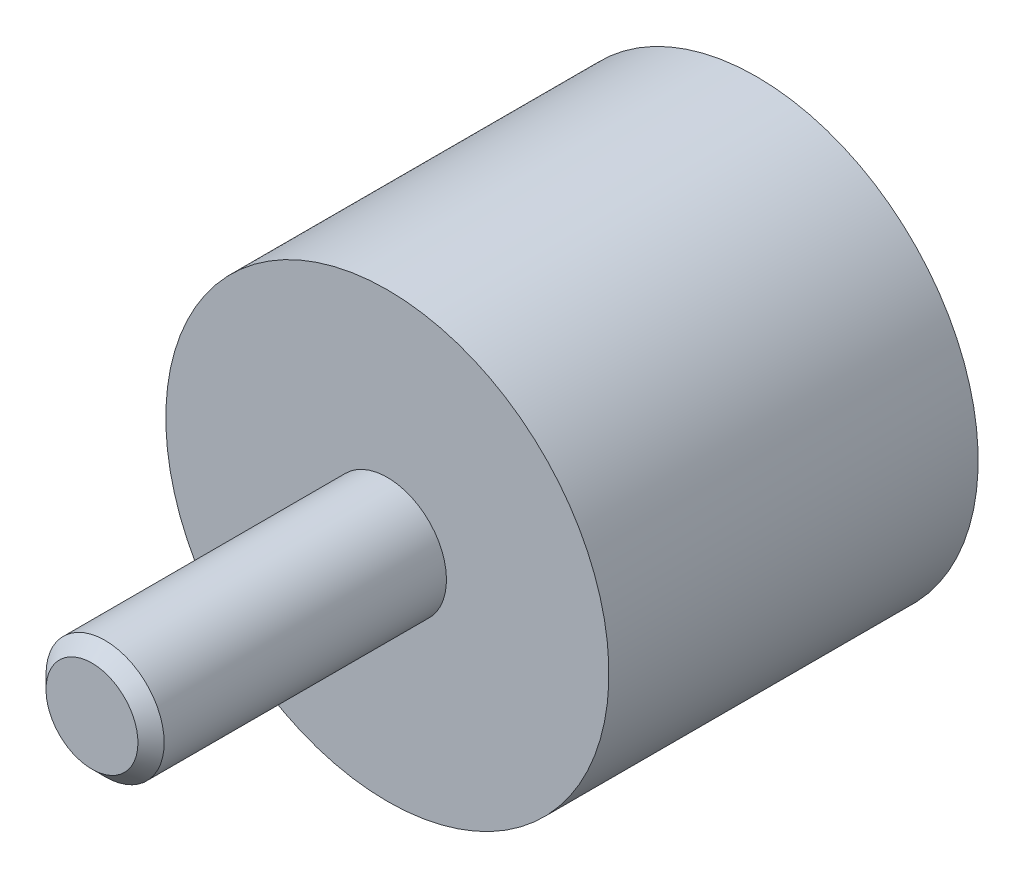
ISO-10303-21;
HEADER;
FILE_DESCRIPTION(('STEP AP214'),'2;1');
FILE_NAME('part.step','',(''),(''),'','','');
FILE_SCHEMA(('AUTOMOTIVE_DESIGN { 1 0 10303 214 1 1 1 1 }'));
ENDSEC;
DATA;
#1=APPLICATION_CONTEXT('core data for automotive mechanical design processes');
#2=APPLICATION_PROTOCOL_DEFINITION('international standard','automotive_design',2000,#1);
#3=PRODUCT_CONTEXT('',#1,'mechanical');
#4=PRODUCT('Part','Part','',(#3));
#5=PRODUCT_RELATED_PRODUCT_CATEGORY('part','',(#4));
#6=PRODUCT_DEFINITION_FORMATION('','',#4);
#7=PRODUCT_DEFINITION_CONTEXT('part definition',#1,'design');
#8=PRODUCT_DEFINITION('design','',#6,#7);
#9=PRODUCT_DEFINITION_SHAPE('','',#8);
#10=(LENGTH_UNIT() NAMED_UNIT(*) SI_UNIT(.MILLI.,.METRE.));
#11=(NAMED_UNIT(*) PLANE_ANGLE_UNIT() SI_UNIT($,.RADIAN.));
#12=(NAMED_UNIT(*) SI_UNIT($,.STERADIAN.) SOLID_ANGLE_UNIT());
#13=UNCERTAINTY_MEASURE_WITH_UNIT(LENGTH_MEASURE(1.E-05),#10,'distance_accuracy_value','');
#14=(GEOMETRIC_REPRESENTATION_CONTEXT(3) GLOBAL_UNCERTAINTY_ASSIGNED_CONTEXT((#13)) GLOBAL_UNIT_ASSIGNED_CONTEXT((#10,
#11,#12)) REPRESENTATION_CONTEXT('',''));
#15=CARTESIAN_POINT('',(0.,0.,0.));
#16=DIRECTION('',(0.,0.,1.));
#17=DIRECTION('',(1.,0.,0.));
#18=AXIS2_PLACEMENT_3D('',#15,#16,#17);
#19=CARTESIAN_POINT('',(0.,0.,0.));
#20=DIRECTION('',(0.,0.,1.));
#21=DIRECTION('',(0.,-1.,0.));
#22=AXIS2_PLACEMENT_3D('',#19,#20,#21);
#23=CYLINDRICAL_SURFACE('',#22,15.);
#24=CARTESIAN_POINT('',(0.,0.,0.));
#25=DIRECTION('',(0.,0.,1.));
#26=DIRECTION('',(0.,-1.,0.));
#27=AXIS2_PLACEMENT_3D('',#24,#25,#26);
#28=CIRCLE('',#27,15.);
#29=CARTESIAN_POINT('',(0.,-15.,0.));
#30=VERTEX_POINT('',#29);
#31=EDGE_CURVE('E18',#30,#30,#28,.T.);
#32=ORIENTED_EDGE('',*,*,#31,.T.);
#33=EDGE_LOOP('',(#32));
#34=FACE_BOUND('',#33,.T.);
#35=CARTESIAN_POINT('',(0.,0.,25.));
#36=DIRECTION('',(0.,0.,-1.));
#37=DIRECTION('',(0.,1.,0.));
#38=AXIS2_PLACEMENT_3D('',#35,#36,#37);
#39=CIRCLE('',#38,15.);
#40=CARTESIAN_POINT('',(0.,15.,25.));
#41=VERTEX_POINT('',#40);
#42=EDGE_CURVE('E22',#41,#41,#39,.T.);
#43=ORIENTED_EDGE('',*,*,#42,.T.);
#44=EDGE_LOOP('',(#43));
#45=FACE_BOUND('',#44,.T.);
#46=ADVANCED_FACE('F12',(#34,#45),#23,.T.);
#47=CARTESIAN_POINT('',(15.,0.,0.));
#48=DIRECTION('',(0.,0.,-1.));
#49=DIRECTION('',(0.,1.,0.));
#50=AXIS2_PLACEMENT_3D('',#47,#48,#49);
#51=PLANE('',#50);
#52=ORIENTED_EDGE('',*,*,#31,.F.);
#53=EDGE_LOOP('',(#52));
#54=FACE_BOUND('',#53,.T.);
#55=ADVANCED_FACE('F48',(#54),#51,.T.);
#56=CARTESIAN_POINT('',(15.,0.,25.));
#57=DIRECTION('',(0.,0.,1.));
#58=DIRECTION('',(0.,-1.,0.));
#59=AXIS2_PLACEMENT_3D('',#56,#57,#58);
#60=PLANE('',#59);
#61=CARTESIAN_POINT('',(0.,0.,25.));
#62=DIRECTION('',(0.,0.,1.));
#63=DIRECTION('',(0.,-1.,0.));
#64=AXIS2_PLACEMENT_3D('',#61,#62,#63);
#65=CIRCLE('',#64,4.);
#66=CARTESIAN_POINT('',(0.,-4.,25.));
#67=VERTEX_POINT('',#66);
#68=EDGE_CURVE('E8',#67,#67,#65,.F.);
#69=ORIENTED_EDGE('',*,*,#68,.T.);
#70=EDGE_LOOP('',(#69));
#71=FACE_BOUND('',#70,.T.);
#72=ORIENTED_EDGE('',*,*,#42,.F.);
#73=EDGE_LOOP('',(#72));
#74=FACE_BOUND('',#73,.T.);
#75=ADVANCED_FACE('F52',(#71,#74),#60,.T.);
#76=CARTESIAN_POINT('',(0.,0.,15.));
#77=DIRECTION('',(0.,0.,1.));
#78=DIRECTION('',(0.,-1.,0.));
#79=AXIS2_PLACEMENT_3D('',#76,#77,#78);
#80=CYLINDRICAL_SURFACE('',#79,4.);
#81=ORIENTED_EDGE('',*,*,#68,.F.);
#82=EDGE_LOOP('',(#81));
#83=FACE_BOUND('',#82,.T.);
#84=CARTESIAN_POINT('',(0.,0.,44.1119886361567));
#85=DIRECTION('',(0.,0.,-1.));
#86=DIRECTION('',(0.,1.,0.));
#87=AXIS2_PLACEMENT_3D('',#84,#85,#86);
#88=CIRCLE('',#87,4.);
#89=CARTESIAN_POINT('',(0.,4.,44.1119886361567));
#90=VERTEX_POINT('',#89);
#91=EDGE_CURVE('E26',#90,#90,#88,.T.);
#92=ORIENTED_EDGE('',*,*,#91,.T.);
#93=EDGE_LOOP('',(#92));
#94=FACE_BOUND('',#93,.T.);
#95=ADVANCED_FACE('F45',(#83,#94),#80,.T.);
#96=CARTESIAN_POINT('',(0.,0.,44.1119886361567));
#97=DIRECTION('',(0.,0.,-1.));
#98=DIRECTION('',(0.,1.,0.));
#99=AXIS2_PLACEMENT_3D('',#96,#97,#98);
#100=CONICAL_SURFACE('',#99,4.,0.785398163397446);
#101=CARTESIAN_POINT('',(0.,0.,45.));
#102=DIRECTION('',(0.,0.,-1.));
#103=DIRECTION('',(0.,1.,0.));
#104=AXIS2_PLACEMENT_3D('',#101,#102,#103);
#105=CIRCLE('',#104,3.11198863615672);
#106=CARTESIAN_POINT('',(0.,3.11198863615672,45.));
#107=VERTEX_POINT('',#106);
#108=EDGE_CURVE('E31',#107,#107,#105,.T.);
#109=ORIENTED_EDGE('',*,*,#108,.T.);
#110=EDGE_LOOP('',(#109));
#111=FACE_BOUND('',#110,.T.);
#112=ORIENTED_EDGE('',*,*,#91,.F.);
#113=EDGE_LOOP('',(#112));
#114=FACE_BOUND('',#113,.T.);
#115=ADVANCED_FACE('F35',(#111,#114),#100,.T.);
#116=CARTESIAN_POINT('',(3.11198863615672,0.,45.));
#117=DIRECTION('',(0.,0.,1.));
#118=DIRECTION('',(0.,-1.,0.));
#119=AXIS2_PLACEMENT_3D('',#116,#117,#118);
#120=PLANE('',#119);
#121=ORIENTED_EDGE('',*,*,#108,.F.);
#122=EDGE_LOOP('',(#121));
#123=FACE_BOUND('',#122,.T.);
#124=ADVANCED_FACE('F38',(#123),#120,.T.);
#125=CLOSED_SHELL('',(#46,#55,#75,#95,#115,#124));
#126=MANIFOLD_SOLID_BREP('B1',#125);
#127=ADVANCED_BREP_SHAPE_REPRESENTATION('',(#18,#126),#14);
#128=SHAPE_DEFINITION_REPRESENTATION(#9,#127);
ENDSEC;
END-ISO-10303-21;
